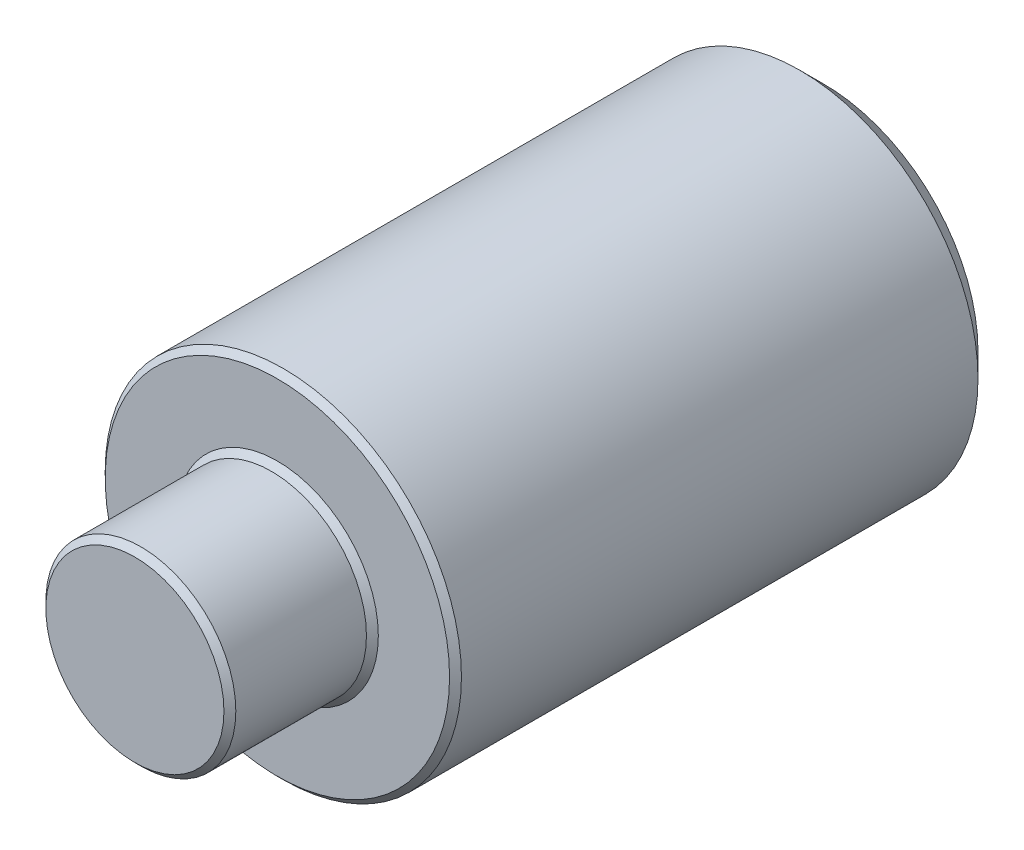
ISO-10303-21;
HEADER;
FILE_DESCRIPTION(('STEP AP214'),'2;1');
FILE_NAME('part.step','',(''),(''),'','','');
FILE_SCHEMA(('AUTOMOTIVE_DESIGN { 1 0 10303 214 1 1 1 1 }'));
ENDSEC;
DATA;
#1=APPLICATION_CONTEXT('core data for automotive mechanical design processes');
#2=APPLICATION_PROTOCOL_DEFINITION('international standard','automotive_design',2000,#1);
#3=PRODUCT_CONTEXT('',#1,'mechanical');
#4=PRODUCT('Part','Part','',(#3));
#5=PRODUCT_RELATED_PRODUCT_CATEGORY('part','',(#4));
#6=PRODUCT_DEFINITION_FORMATION('','',#4);
#7=PRODUCT_DEFINITION_CONTEXT('part definition',#1,'design');
#8=PRODUCT_DEFINITION('design','',#6,#7);
#9=PRODUCT_DEFINITION_SHAPE('','',#8);
#10=(LENGTH_UNIT() NAMED_UNIT(*) SI_UNIT(.MILLI.,.METRE.));
#11=(NAMED_UNIT(*) PLANE_ANGLE_UNIT() SI_UNIT($,.RADIAN.));
#12=(NAMED_UNIT(*) SI_UNIT($,.STERADIAN.) SOLID_ANGLE_UNIT());
#13=UNCERTAINTY_MEASURE_WITH_UNIT(LENGTH_MEASURE(1.E-05),#10,'distance_accuracy_value','');
#14=(GEOMETRIC_REPRESENTATION_CONTEXT(3) GLOBAL_UNCERTAINTY_ASSIGNED_CONTEXT((#13)) GLOBAL_UNIT_ASSIGNED_CONTEXT((#10,
#11,#12)) REPRESENTATION_CONTEXT('',''));
#15=CARTESIAN_POINT('',(0.,0.,0.));
#16=DIRECTION('',(0.,0.,1.));
#17=DIRECTION('',(1.,0.,0.));
#18=AXIS2_PLACEMENT_3D('',#15,#16,#17);
#19=CARTESIAN_POINT('',(0.,0.,23.));
#20=DIRECTION('',(0.,0.,1.));
#21=DIRECTION('',(1.,0.,0.));
#22=AXIS2_PLACEMENT_3D('',#19,#20,#21);
#23=PLANE('',#22);
#24=CARTESIAN_POINT('',(0.,0.,23.));
#25=DIRECTION('',(0.,0.,1.));
#26=DIRECTION('',(1.,0.,0.));
#27=AXIS2_PLACEMENT_3D('',#24,#25,#26);
#28=CIRCLE('',#27,4.25);
#29=CARTESIAN_POINT('',(4.25,0.,23.));
#30=VERTEX_POINT('',#29);
#31=EDGE_CURVE('E35',#30,#30,#28,.F.);
#32=ORIENTED_EDGE('',*,*,#31,.T.);
#33=EDGE_LOOP('',(#32));
#34=FACE_BOUND('',#33,.T.);
#35=CARTESIAN_POINT('',(0.,0.,23.));
#36=DIRECTION('',(0.,0.,1.));
#37=DIRECTION('',(1.,0.,0.));
#38=AXIS2_PLACEMENT_3D('',#35,#36,#37);
#39=CIRCLE('',#38,7.25);
#40=CARTESIAN_POINT('',(7.25,0.,23.));
#41=VERTEX_POINT('',#40);
#42=EDGE_CURVE('E39',#41,#41,#39,.T.);
#43=ORIENTED_EDGE('',*,*,#42,.T.);
#44=EDGE_LOOP('',(#43));
#45=FACE_BOUND('',#44,.T.);
#46=ADVANCED_FACE('F28',(#34,#45),#23,.T.);
#47=CARTESIAN_POINT('',(0.,0.,23.));
#48=DIRECTION('',(0.,0.,-1.));
#49=DIRECTION('',(-1.,0.,0.));
#50=AXIS2_PLACEMENT_3D('',#47,#48,#49);
#51=CYLINDRICAL_SURFACE('',#50,7.5);
#52=CARTESIAN_POINT('',(0.,0.,22.75));
#53=DIRECTION('',(0.,0.,1.));
#54=DIRECTION('',(1.,0.,0.));
#55=AXIS2_PLACEMENT_3D('',#52,#53,#54);
#56=CIRCLE('',#55,7.5);
#57=CARTESIAN_POINT('',(7.5,0.,22.75));
#58=VERTEX_POINT('',#57);
#59=EDGE_CURVE('E10',#58,#58,#56,.F.);
#60=ORIENTED_EDGE('',*,*,#59,.T.);
#61=EDGE_LOOP('',(#60));
#62=FACE_BOUND('',#61,.T.);
#63=CARTESIAN_POINT('',(0.,0.,1.));
#64=DIRECTION('',(0.,0.,1.));
#65=DIRECTION('',(1.,0.,0.));
#66=AXIS2_PLACEMENT_3D('',#63,#64,#65);
#67=CIRCLE('',#66,7.5);
#68=CARTESIAN_POINT('',(7.5,0.,1.));
#69=VERTEX_POINT('',#68);
#70=EDGE_CURVE('E57',#69,#69,#67,.T.);
#71=ORIENTED_EDGE('',*,*,#70,.T.);
#72=EDGE_LOOP('',(#71));
#73=FACE_BOUND('',#72,.T.);
#74=ADVANCED_FACE('F61',(#62,#73),#51,.T.);
#75=CARTESIAN_POINT('',(0.,0.,0.));
#76=DIRECTION('',(0.,0.,1.));
#77=DIRECTION('',(1.,0.,0.));
#78=AXIS2_PLACEMENT_3D('',#75,#76,#77);
#79=PLANE('',#78);
#80=CARTESIAN_POINT('',(0.,0.,0.));
#81=DIRECTION('',(0.,0.,1.));
#82=DIRECTION('',(1.,0.,0.));
#83=AXIS2_PLACEMENT_3D('',#80,#81,#82);
#84=CIRCLE('',#83,6.49999999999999);
#85=CARTESIAN_POINT('',(6.49999999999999,0.,0.));
#86=VERTEX_POINT('',#85);
#87=EDGE_CURVE('E54',#86,#86,#84,.F.);
#88=ORIENTED_EDGE('',*,*,#87,.T.);
#89=EDGE_LOOP('',(#88));
#90=FACE_BOUND('',#89,.T.);
#91=ADVANCED_FACE('F86',(#90),#79,.F.);
#92=CARTESIAN_POINT('',(0.,0.,29.));
#93=DIRECTION('',(0.,0.,-1.));
#94=DIRECTION('',(-1.,0.,0.));
#95=AXIS2_PLACEMENT_3D('',#92,#93,#94);
#96=CYLINDRICAL_SURFACE('',#95,4.);
#97=CARTESIAN_POINT('',(0.,0.,28.75));
#98=DIRECTION('',(0.,0.,1.));
#99=DIRECTION('',(1.,0.,0.));
#100=AXIS2_PLACEMENT_3D('',#97,#98,#99);
#101=CIRCLE('',#100,4.);
#102=CARTESIAN_POINT('',(4.,0.,28.75));
#103=VERTEX_POINT('',#102);
#104=EDGE_CURVE('E43',#103,#103,#101,.F.);
#105=ORIENTED_EDGE('',*,*,#104,.T.);
#106=EDGE_LOOP('',(#105));
#107=FACE_BOUND('',#106,.T.);
#108=CARTESIAN_POINT('',(0.,0.,23.25));
#109=DIRECTION('',(0.,0.,1.));
#110=DIRECTION('',(1.,0.,0.));
#111=AXIS2_PLACEMENT_3D('',#108,#109,#110);
#112=CIRCLE('',#111,4.);
#113=CARTESIAN_POINT('',(4.,0.,23.25));
#114=VERTEX_POINT('',#113);
#115=EDGE_CURVE('E48',#114,#114,#112,.T.);
#116=ORIENTED_EDGE('',*,*,#115,.T.);
#117=EDGE_LOOP('',(#116));
#118=FACE_BOUND('',#117,.T.);
#119=ADVANCED_FACE('F76',(#107,#118),#96,.T.);
#120=CARTESIAN_POINT('',(0.,0.,29.));
#121=DIRECTION('',(0.,0.,1.));
#122=DIRECTION('',(1.,0.,0.));
#123=AXIS2_PLACEMENT_3D('',#120,#121,#122);
#124=PLANE('',#123);
#125=CARTESIAN_POINT('',(0.,0.,29.));
#126=DIRECTION('',(0.,0.,1.));
#127=DIRECTION('',(1.,0.,0.));
#128=AXIS2_PLACEMENT_3D('',#125,#126,#127);
#129=CIRCLE('',#128,3.75);
#130=CARTESIAN_POINT('',(3.75,0.,29.));
#131=VERTEX_POINT('',#130);
#132=EDGE_CURVE('E51',#131,#131,#129,.T.);
#133=ORIENTED_EDGE('',*,*,#132,.T.);
#134=EDGE_LOOP('',(#133));
#135=FACE_BOUND('',#134,.T.);
#136=ADVANCED_FACE('F66',(#135),#124,.T.);
#137=CARTESIAN_POINT('',(0.,0.,1.));
#138=DIRECTION('',(0.,0.,1.));
#139=DIRECTION('',(1.,0.,0.));
#140=AXIS2_PLACEMENT_3D('',#137,#138,#139);
#141=CONICAL_SURFACE('',#140,7.5,0.78539816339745);
#142=ORIENTED_EDGE('',*,*,#87,.F.);
#143=EDGE_LOOP('',(#142));
#144=FACE_BOUND('',#143,.T.);
#145=ORIENTED_EDGE('',*,*,#70,.F.);
#146=EDGE_LOOP('',(#145));
#147=FACE_BOUND('',#146,.T.);
#148=ADVANCED_FACE('F63',(#144,#147),#141,.T.);
#149=CARTESIAN_POINT('',(0.,0.,29.));
#150=DIRECTION('',(0.,0.,-1.));
#151=DIRECTION('',(-1.,0.,0.));
#152=AXIS2_PLACEMENT_3D('',#149,#150,#151);
#153=CONICAL_SURFACE('',#152,3.75,0.785398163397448);
#154=ORIENTED_EDGE('',*,*,#104,.F.);
#155=EDGE_LOOP('',(#154));
#156=FACE_BOUND('',#155,.T.);
#157=ORIENTED_EDGE('',*,*,#132,.F.);
#158=EDGE_LOOP('',(#157));
#159=FACE_BOUND('',#158,.T.);
#160=ADVANCED_FACE('F65',(#156,#159),#153,.T.);
#161=CARTESIAN_POINT('',(0.,0.,23.25));
#162=DIRECTION('',(0.,0.,-1.));
#163=DIRECTION('',(-1.,0.,0.));
#164=AXIS2_PLACEMENT_3D('',#161,#162,#163);
#165=CONICAL_SURFACE('',#164,4.,0.785398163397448);
#166=ORIENTED_EDGE('',*,*,#31,.F.);
#167=EDGE_LOOP('',(#166));
#168=FACE_BOUND('',#167,.T.);
#169=ORIENTED_EDGE('',*,*,#115,.F.);
#170=EDGE_LOOP('',(#169));
#171=FACE_BOUND('',#170,.T.);
#172=ADVANCED_FACE('F73',(#168,#171),#165,.T.);
#173=CARTESIAN_POINT('',(0.,0.,23.));
#174=DIRECTION('',(0.,0.,-1.));
#175=DIRECTION('',(-1.,0.,0.));
#176=AXIS2_PLACEMENT_3D('',#173,#174,#175);
#177=CONICAL_SURFACE('',#176,7.25,0.785398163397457);
#178=ORIENTED_EDGE('',*,*,#59,.F.);
#179=EDGE_LOOP('',(#178));
#180=FACE_BOUND('',#179,.T.);
#181=ORIENTED_EDGE('',*,*,#42,.F.);
#182=EDGE_LOOP('',(#181));
#183=FACE_BOUND('',#182,.T.);
#184=ADVANCED_FACE('F30',(#180,#183),#177,.T.);
#185=CLOSED_SHELL('',(#46,#74,#91,#119,#136,#148,#160,#172,#184));
#186=MANIFOLD_SOLID_BREP('B2',#185);
#187=ADVANCED_BREP_SHAPE_REPRESENTATION('',(#18,#186),#14);
#188=SHAPE_DEFINITION_REPRESENTATION(#9,#187);
ENDSEC;
END-ISO-10303-21;
